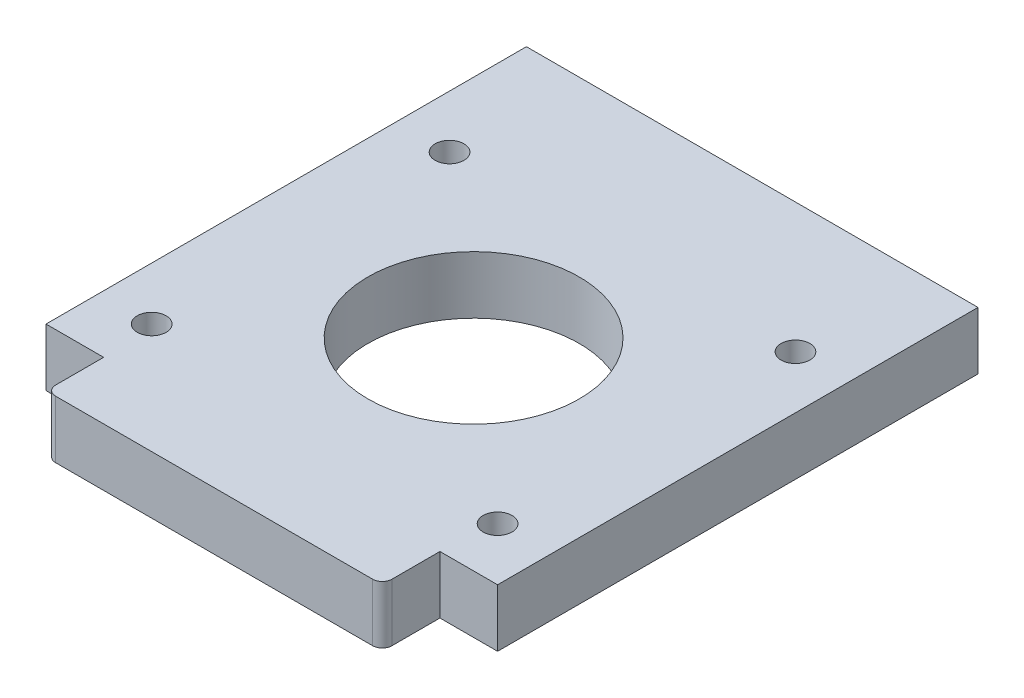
ISO-10303-21;
HEADER;
FILE_DESCRIPTION(('STEP AP214'),'2;1');
FILE_NAME('part.step','',(''),(''),'','','');
FILE_SCHEMA(('AUTOMOTIVE_DESIGN { 1 0 10303 214 1 1 1 1 }'));
ENDSEC;
DATA;
#1=APPLICATION_CONTEXT('core data for automotive mechanical design processes');
#2=APPLICATION_PROTOCOL_DEFINITION('international standard','automotive_design',2000,#1);
#3=PRODUCT_CONTEXT('',#1,'mechanical');
#4=PRODUCT('Part','Part','',(#3));
#5=PRODUCT_RELATED_PRODUCT_CATEGORY('part','',(#4));
#6=PRODUCT_DEFINITION_FORMATION('','',#4);
#7=PRODUCT_DEFINITION_CONTEXT('part definition',#1,'design');
#8=PRODUCT_DEFINITION('design','',#6,#7);
#9=PRODUCT_DEFINITION_SHAPE('','',#8);
#10=(LENGTH_UNIT() NAMED_UNIT(*) SI_UNIT(.MILLI.,.METRE.));
#11=(NAMED_UNIT(*) PLANE_ANGLE_UNIT() SI_UNIT($,.RADIAN.));
#12=(NAMED_UNIT(*) SI_UNIT($,.STERADIAN.) SOLID_ANGLE_UNIT());
#13=UNCERTAINTY_MEASURE_WITH_UNIT(LENGTH_MEASURE(1.E-05),#10,'distance_accuracy_value','');
#14=(GEOMETRIC_REPRESENTATION_CONTEXT(3) GLOBAL_UNCERTAINTY_ASSIGNED_CONTEXT((#13)) GLOBAL_UNIT_ASSIGNED_CONTEXT((#10,
#11,#12)) REPRESENTATION_CONTEXT('',''));
#15=CARTESIAN_POINT('',(0.,0.,0.));
#16=DIRECTION('',(0.,0.,1.));
#17=DIRECTION('',(1.,0.,0.));
#18=AXIS2_PLACEMENT_3D('',#15,#16,#17);
#19=CARTESIAN_POINT('',(0.,6.,0.));
#20=DIRECTION('',(0.,-1.,0.));
#21=DIRECTION('',(0.,0.,-1.));
#22=AXIS2_PLACEMENT_3D('',#19,#20,#21);
#23=PLANE('',#22);
#24=DIRECTION('',(1.,0.,0.));
#25=VECTOR('',#24,1.);
#26=CARTESIAN_POINT('',(-17.5,6.,27.));
#27=LINE('',#26,#25);
#28=CARTESIAN_POINT('',(-16.5,6.,27.));
#29=VERTEX_POINT('',#28);
#30=CARTESIAN_POINT('',(16.5,6.,27.));
#31=VERTEX_POINT('',#30);
#32=EDGE_CURVE('E177',#29,#31,#27,.T.);
#33=ORIENTED_EDGE('',*,*,#32,.T.);
#34=CARTESIAN_POINT('',(16.5,6.,26.));
#35=DIRECTION('',(0.,-1.,0.));
#36=DIRECTION('',(0.,0.,-1.));
#37=AXIS2_PLACEMENT_3D('',#34,#35,#36);
#38=CIRCLE('',#37,1.);
#39=CARTESIAN_POINT('',(17.5,6.,26.));
#40=VERTEX_POINT('',#39);
#41=EDGE_CURVE('E52',#31,#40,#38,.F.);
#42=ORIENTED_EDGE('',*,*,#41,.T.);
#43=DIRECTION('',(0.,0.,-1.));
#44=VECTOR('',#43,1.);
#45=CARTESIAN_POINT('',(17.5,6.,27.));
#46=LINE('',#45,#44);
#47=CARTESIAN_POINT('',(17.5,6.,21.));
#48=VERTEX_POINT('',#47);
#49=EDGE_CURVE('E140',#40,#48,#46,.T.);
#50=ORIENTED_EDGE('',*,*,#49,.T.);
#51=DIRECTION('',(1.,0.,0.));
#52=VECTOR('',#51,1.);
#53=CARTESIAN_POINT('',(17.5,6.,21.));
#54=LINE('',#53,#52);
#55=CARTESIAN_POINT('',(23.5,6.,21.));
#56=VERTEX_POINT('',#55);
#57=EDGE_CURVE('E135',#48,#56,#54,.T.);
#58=ORIENTED_EDGE('',*,*,#57,.T.);
#59=DIRECTION('',(0.,0.,-1.));
#60=VECTOR('',#59,1.);
#61=CARTESIAN_POINT('',(23.5,6.,-21.));
#62=LINE('',#61,#60);
#63=CARTESIAN_POINT('',(23.5,6.,-29.));
#64=VERTEX_POINT('',#63);
#65=EDGE_CURVE('E123',#56,#64,#62,.T.);
#66=ORIENTED_EDGE('',*,*,#65,.T.);
#67=DIRECTION('',(-1.,0.,0.));
#68=VECTOR('',#67,1.);
#69=CARTESIAN_POINT('',(-23.5,6.,-29.));
#70=LINE('',#69,#68);
#71=CARTESIAN_POINT('',(-23.5,6.,-29.));
#72=VERTEX_POINT('',#71);
#73=EDGE_CURVE('E134',#64,#72,#70,.T.);
#74=ORIENTED_EDGE('',*,*,#73,.T.);
#75=DIRECTION('',(0.,0.,1.));
#76=VECTOR('',#75,1.);
#77=CARTESIAN_POINT('',(-23.5,6.,-21.));
#78=LINE('',#77,#76);
#79=CARTESIAN_POINT('',(-23.5,6.,21.));
#80=VERTEX_POINT('',#79);
#81=EDGE_CURVE('E221',#72,#80,#78,.T.);
#82=ORIENTED_EDGE('',*,*,#81,.T.);
#83=DIRECTION('',(1.,0.,0.));
#84=VECTOR('',#83,1.);
#85=CARTESIAN_POINT('',(-23.5,6.,21.));
#86=LINE('',#85,#84);
#87=CARTESIAN_POINT('',(-17.5,6.,21.));
#88=VERTEX_POINT('',#87);
#89=EDGE_CURVE('E249',#80,#88,#86,.T.);
#90=ORIENTED_EDGE('',*,*,#89,.T.);
#91=DIRECTION('',(0.,0.,1.));
#92=VECTOR('',#91,1.);
#93=CARTESIAN_POINT('',(-17.5,6.,21.));
#94=LINE('',#93,#92);
#95=CARTESIAN_POINT('',(-17.5,6.,26.));
#96=VERTEX_POINT('',#95);
#97=EDGE_CURVE('E243',#88,#96,#94,.T.);
#98=ORIENTED_EDGE('',*,*,#97,.T.);
#99=CARTESIAN_POINT('',(-16.5,6.,26.));
#100=DIRECTION('',(0.,-1.,0.));
#101=DIRECTION('',(0.,0.,-1.));
#102=AXIS2_PLACEMENT_3D('',#99,#100,#101);
#103=CIRCLE('',#102,1.);
#104=EDGE_CURVE('E173',#96,#29,#103,.F.);
#105=ORIENTED_EDGE('',*,*,#104,.T.);
#106=EDGE_LOOP('',(#33,#42,#50,#58,#66,#74,#82,#90,#98,#105));
#107=FACE_BOUND('',#106,.T.);
#108=CARTESIAN_POINT('',(0.,6.,0.));
#109=DIRECTION('',(0.,1.,0.));
#110=DIRECTION('',(0.,0.,1.));
#111=AXIS2_PLACEMENT_3D('',#108,#109,#110);
#112=CIRCLE('',#111,11.);
#113=CARTESIAN_POINT('',(0.,6.,11.));
#114=VERTEX_POINT('',#113);
#115=EDGE_CURVE('E253',#114,#114,#112,.T.);
#116=ORIENTED_EDGE('',*,*,#115,.F.);
#117=EDGE_LOOP('',(#116));
#118=FACE_BOUND('',#117,.T.);
#119=CARTESIAN_POINT('',(-18.,6.,15.5));
#120=DIRECTION('',(0.,1.,0.));
#121=DIRECTION('',(0.,0.,1.));
#122=AXIS2_PLACEMENT_3D('',#119,#120,#121);
#123=CIRCLE('',#122,1.5);
#124=CARTESIAN_POINT('',(-18.,6.,17.));
#125=VERTEX_POINT('',#124);
#126=EDGE_CURVE('E262',#125,#125,#123,.T.);
#127=ORIENTED_EDGE('',*,*,#126,.F.);
#128=EDGE_LOOP('',(#127));
#129=FACE_BOUND('',#128,.T.);
#130=CARTESIAN_POINT('',(18.,6.,15.5));
#131=DIRECTION('',(0.,1.,0.));
#132=DIRECTION('',(0.,0.,-1.));
#133=AXIS2_PLACEMENT_3D('',#130,#131,#132);
#134=CIRCLE('',#133,1.5);
#135=CARTESIAN_POINT('',(18.,6.,14.));
#136=VERTEX_POINT('',#135);
#137=EDGE_CURVE('E274',#136,#136,#134,.T.);
#138=ORIENTED_EDGE('',*,*,#137,.F.);
#139=EDGE_LOOP('',(#138));
#140=FACE_BOUND('',#139,.T.);
#141=CARTESIAN_POINT('',(18.,6.,-15.5));
#142=DIRECTION('',(0.,1.,0.));
#143=DIRECTION('',(0.,0.,1.));
#144=AXIS2_PLACEMENT_3D('',#141,#142,#143);
#145=CIRCLE('',#144,1.5);
#146=CARTESIAN_POINT('',(18.,6.,-14.));
#147=VERTEX_POINT('',#146);
#148=EDGE_CURVE('E282',#147,#147,#145,.T.);
#149=ORIENTED_EDGE('',*,*,#148,.F.);
#150=EDGE_LOOP('',(#149));
#151=FACE_BOUND('',#150,.T.);
#152=CARTESIAN_POINT('',(-18.,6.,-15.5));
#153=DIRECTION('',(0.,1.,0.));
#154=DIRECTION('',(0.,0.,-1.));
#155=AXIS2_PLACEMENT_3D('',#152,#153,#154);
#156=CIRCLE('',#155,1.5);
#157=CARTESIAN_POINT('',(-18.,6.,-17.));
#158=VERTEX_POINT('',#157);
#159=EDGE_CURVE('E290',#158,#158,#156,.T.);
#160=ORIENTED_EDGE('',*,*,#159,.F.);
#161=EDGE_LOOP('',(#160));
#162=FACE_BOUND('',#161,.T.);
#163=ADVANCED_FACE('F43',(#107,#118,#129,#140,#151,#162),#23,.F.);
#164=CARTESIAN_POINT('',(0.,0.,0.));
#165=DIRECTION('',(0.,-1.,0.));
#166=DIRECTION('',(0.,0.,-1.));
#167=AXIS2_PLACEMENT_3D('',#164,#165,#166);
#168=PLANE('',#167);
#169=CARTESIAN_POINT('',(18.,0.,-15.5));
#170=DIRECTION('',(0.,1.,0.));
#171=DIRECTION('',(0.,0.,1.));
#172=AXIS2_PLACEMENT_3D('',#169,#170,#171);
#173=CIRCLE('',#172,1.5);
#174=CARTESIAN_POINT('',(18.,0.,-14.));
#175=VERTEX_POINT('',#174);
#176=EDGE_CURVE('E286',#175,#175,#173,.T.);
#177=ORIENTED_EDGE('',*,*,#176,.T.);
#178=EDGE_LOOP('',(#177));
#179=FACE_BOUND('',#178,.T.);
#180=CARTESIAN_POINT('',(-18.,0.,15.5));
#181=DIRECTION('',(0.,1.,0.));
#182=DIRECTION('',(0.,0.,1.));
#183=AXIS2_PLACEMENT_3D('',#180,#181,#182);
#184=CIRCLE('',#183,1.5);
#185=CARTESIAN_POINT('',(-18.,0.,17.));
#186=VERTEX_POINT('',#185);
#187=EDGE_CURVE('E265',#186,#186,#184,.T.);
#188=ORIENTED_EDGE('',*,*,#187,.T.);
#189=EDGE_LOOP('',(#188));
#190=FACE_BOUND('',#189,.T.);
#191=DIRECTION('',(0.,0.,-1.));
#192=VECTOR('',#191,1.);
#193=CARTESIAN_POINT('',(17.5,0.,27.));
#194=LINE('',#193,#192);
#195=CARTESIAN_POINT('',(17.5,0.,26.));
#196=VERTEX_POINT('',#195);
#197=CARTESIAN_POINT('',(17.5,0.,21.));
#198=VERTEX_POINT('',#197);
#199=EDGE_CURVE('E145',#196,#198,#194,.T.);
#200=ORIENTED_EDGE('',*,*,#199,.F.);
#201=CARTESIAN_POINT('',(16.5,0.,26.));
#202=DIRECTION('',(0.,-1.,0.));
#203=DIRECTION('',(0.,0.,-1.));
#204=AXIS2_PLACEMENT_3D('',#201,#202,#203);
#205=CIRCLE('',#204,1.);
#206=CARTESIAN_POINT('',(16.5,0.,27.));
#207=VERTEX_POINT('',#206);
#208=EDGE_CURVE('E164',#196,#207,#205,.T.);
#209=ORIENTED_EDGE('',*,*,#208,.T.);
#210=DIRECTION('',(1.,0.,0.));
#211=VECTOR('',#210,1.);
#212=CARTESIAN_POINT('',(-17.5,0.,27.));
#213=LINE('',#212,#211);
#214=CARTESIAN_POINT('',(-16.5,0.,27.));
#215=VERTEX_POINT('',#214);
#216=EDGE_CURVE('E191',#215,#207,#213,.T.);
#217=ORIENTED_EDGE('',*,*,#216,.F.);
#218=CARTESIAN_POINT('',(-16.5,0.,26.));
#219=DIRECTION('',(0.,-1.,0.));
#220=DIRECTION('',(0.,0.,-1.));
#221=AXIS2_PLACEMENT_3D('',#218,#219,#220);
#222=CIRCLE('',#221,1.);
#223=CARTESIAN_POINT('',(-17.5,0.,26.));
#224=VERTEX_POINT('',#223);
#225=EDGE_CURVE('E156',#215,#224,#222,.T.);
#226=ORIENTED_EDGE('',*,*,#225,.T.);
#227=DIRECTION('',(0.,0.,1.));
#228=VECTOR('',#227,1.);
#229=CARTESIAN_POINT('',(-17.5,0.,21.));
#230=LINE('',#229,#228);
#231=CARTESIAN_POINT('',(-17.5,0.,21.));
#232=VERTEX_POINT('',#231);
#233=EDGE_CURVE('E195',#232,#224,#230,.T.);
#234=ORIENTED_EDGE('',*,*,#233,.F.);
#235=DIRECTION('',(1.,0.,0.));
#236=VECTOR('',#235,1.);
#237=CARTESIAN_POINT('',(-23.5,0.,21.));
#238=LINE('',#237,#236);
#239=CARTESIAN_POINT('',(-23.5,0.,21.));
#240=VERTEX_POINT('',#239);
#241=EDGE_CURVE('E200',#240,#232,#238,.T.);
#242=ORIENTED_EDGE('',*,*,#241,.F.);
#243=DIRECTION('',(0.,0.,1.));
#244=VECTOR('',#243,1.);
#245=CARTESIAN_POINT('',(-23.5,0.,-21.));
#246=LINE('',#245,#244);
#247=CARTESIAN_POINT('',(-23.5,0.,-29.));
#248=VERTEX_POINT('',#247);
#249=EDGE_CURVE('E220',#248,#240,#246,.T.);
#250=ORIENTED_EDGE('',*,*,#249,.F.);
#251=DIRECTION('',(-1.,0.,0.));
#252=VECTOR('',#251,1.);
#253=CARTESIAN_POINT('',(-23.5,0.,-29.));
#254=LINE('',#253,#252);
#255=CARTESIAN_POINT('',(23.5,0.,-29.));
#256=VERTEX_POINT('',#255);
#257=EDGE_CURVE('E226',#256,#248,#254,.T.);
#258=ORIENTED_EDGE('',*,*,#257,.F.);
#259=DIRECTION('',(0.,0.,-1.));
#260=VECTOR('',#259,1.);
#261=CARTESIAN_POINT('',(23.5,0.,-29.));
#262=LINE('',#261,#260);
#263=CARTESIAN_POINT('',(23.5,0.,21.));
#264=VERTEX_POINT('',#263);
#265=EDGE_CURVE('E228',#264,#256,#262,.T.);
#266=ORIENTED_EDGE('',*,*,#265,.F.);
#267=DIRECTION('',(1.,0.,0.));
#268=VECTOR('',#267,1.);
#269=CARTESIAN_POINT('',(17.5,0.,21.));
#270=LINE('',#269,#268);
#271=EDGE_CURVE('E149',#198,#264,#270,.T.);
#272=ORIENTED_EDGE('',*,*,#271,.F.);
#273=EDGE_LOOP('',(#200,#209,#217,#226,#234,#242,#250,#258,#266,#272));
#274=FACE_BOUND('',#273,.T.);
#275=CARTESIAN_POINT('',(0.,0.,0.));
#276=DIRECTION('',(0.,1.,0.));
#277=DIRECTION('',(0.,0.,1.));
#278=AXIS2_PLACEMENT_3D('',#275,#276,#277);
#279=CIRCLE('',#278,11.);
#280=CARTESIAN_POINT('',(0.,0.,11.));
#281=VERTEX_POINT('',#280);
#282=EDGE_CURVE('E256',#281,#281,#279,.T.);
#283=ORIENTED_EDGE('',*,*,#282,.T.);
#284=EDGE_LOOP('',(#283));
#285=FACE_BOUND('',#284,.T.);
#286=CARTESIAN_POINT('',(18.,0.,15.5));
#287=DIRECTION('',(0.,1.,0.));
#288=DIRECTION('',(0.,0.,-1.));
#289=AXIS2_PLACEMENT_3D('',#286,#287,#288);
#290=CIRCLE('',#289,1.5);
#291=CARTESIAN_POINT('',(18.,0.,14.));
#292=VERTEX_POINT('',#291);
#293=EDGE_CURVE('E278',#292,#292,#290,.T.);
#294=ORIENTED_EDGE('',*,*,#293,.T.);
#295=EDGE_LOOP('',(#294));
#296=FACE_BOUND('',#295,.T.);
#297=CARTESIAN_POINT('',(-18.,0.,-15.5));
#298=DIRECTION('',(0.,1.,0.));
#299=DIRECTION('',(0.,0.,-1.));
#300=AXIS2_PLACEMENT_3D('',#297,#298,#299);
#301=CIRCLE('',#300,1.5);
#302=CARTESIAN_POINT('',(-18.,0.,-17.));
#303=VERTEX_POINT('',#302);
#304=EDGE_CURVE('E294',#303,#303,#301,.T.);
#305=ORIENTED_EDGE('',*,*,#304,.T.);
#306=EDGE_LOOP('',(#305));
#307=FACE_BOUND('',#306,.T.);
#308=ADVANCED_FACE('F189',(#179,#190,#274,#285,#296,#307),#168,.T.);
#309=CARTESIAN_POINT('',(17.5,6.,21.));
#310=DIRECTION('',(0.,0.,-1.));
#311=DIRECTION('',(-1.,0.,0.));
#312=AXIS2_PLACEMENT_3D('',#309,#310,#311);
#313=PLANE('',#312);
#314=ORIENTED_EDGE('',*,*,#271,.T.);
#315=DIRECTION('',(0.,-1.,0.));
#316=VECTOR('',#315,1.);
#317=CARTESIAN_POINT('',(23.5,6.,21.));
#318=LINE('',#317,#316);
#319=EDGE_CURVE('E127',#56,#264,#318,.T.);
#320=ORIENTED_EDGE('',*,*,#319,.F.);
#321=ORIENTED_EDGE('',*,*,#57,.F.);
#322=DIRECTION('',(0.,-1.,0.));
#323=VECTOR('',#322,1.);
#324=CARTESIAN_POINT('',(17.5,6.,21.));
#325=LINE('',#324,#323);
#326=EDGE_CURVE('E183',#48,#198,#325,.T.);
#327=ORIENTED_EDGE('',*,*,#326,.T.);
#328=EDGE_LOOP('',(#314,#320,#321,#327));
#329=FACE_BOUND('',#328,.T.);
#330=ADVANCED_FACE('F147',(#329),#313,.F.);
#331=CARTESIAN_POINT('',(23.5,6.,-29.));
#332=DIRECTION('',(-1.,0.,0.));
#333=DIRECTION('',(0.,0.,1.));
#334=AXIS2_PLACEMENT_3D('',#331,#332,#333);
#335=PLANE('',#334);
#336=ORIENTED_EDGE('',*,*,#265,.T.);
#337=DIRECTION('',(0.,-1.,0.));
#338=VECTOR('',#337,1.);
#339=CARTESIAN_POINT('',(23.5,6.,-29.));
#340=LINE('',#339,#338);
#341=EDGE_CURVE('E130',#64,#256,#340,.T.);
#342=ORIENTED_EDGE('',*,*,#341,.F.);
#343=ORIENTED_EDGE('',*,*,#65,.F.);
#344=ORIENTED_EDGE('',*,*,#319,.T.);
#345=EDGE_LOOP('',(#336,#342,#343,#344));
#346=FACE_BOUND('',#345,.T.);
#347=ADVANCED_FACE('F125',(#346),#335,.F.);
#348=CARTESIAN_POINT('',(-23.5,6.,-29.));
#349=DIRECTION('',(0.,0.,1.));
#350=DIRECTION('',(1.,0.,0.));
#351=AXIS2_PLACEMENT_3D('',#348,#349,#350);
#352=PLANE('',#351);
#353=ORIENTED_EDGE('',*,*,#257,.T.);
#354=DIRECTION('',(0.,-1.,0.));
#355=VECTOR('',#354,1.);
#356=CARTESIAN_POINT('',(-23.5,6.,-29.));
#357=LINE('',#356,#355);
#358=EDGE_CURVE('E158',#72,#248,#357,.T.);
#359=ORIENTED_EDGE('',*,*,#358,.F.);
#360=ORIENTED_EDGE('',*,*,#73,.F.);
#361=ORIENTED_EDGE('',*,*,#341,.T.);
#362=EDGE_LOOP('',(#353,#359,#360,#361));
#363=FACE_BOUND('',#362,.T.);
#364=ADVANCED_FACE('F224',(#363),#352,.F.);
#365=CARTESIAN_POINT('',(-23.5,6.,-21.));
#366=DIRECTION('',(1.,0.,0.));
#367=DIRECTION('',(0.,0.,-1.));
#368=AXIS2_PLACEMENT_3D('',#365,#366,#367);
#369=PLANE('',#368);
#370=ORIENTED_EDGE('',*,*,#249,.T.);
#371=DIRECTION('',(0.,-1.,0.));
#372=VECTOR('',#371,1.);
#373=CARTESIAN_POINT('',(-23.5,6.,21.));
#374=LINE('',#373,#372);
#375=EDGE_CURVE('E210',#80,#240,#374,.T.);
#376=ORIENTED_EDGE('',*,*,#375,.F.);
#377=ORIENTED_EDGE('',*,*,#81,.F.);
#378=ORIENTED_EDGE('',*,*,#358,.T.);
#379=EDGE_LOOP('',(#370,#376,#377,#378));
#380=FACE_BOUND('',#379,.T.);
#381=ADVANCED_FACE('F218',(#380),#369,.F.);
#382=CARTESIAN_POINT('',(-23.5,6.,21.));
#383=DIRECTION('',(0.,0.,-1.));
#384=DIRECTION('',(-1.,0.,0.));
#385=AXIS2_PLACEMENT_3D('',#382,#383,#384);
#386=PLANE('',#385);
#387=ORIENTED_EDGE('',*,*,#241,.T.);
#388=DIRECTION('',(0.,-1.,0.));
#389=VECTOR('',#388,1.);
#390=CARTESIAN_POINT('',(-17.5,6.,21.));
#391=LINE('',#390,#389);
#392=EDGE_CURVE('E206',#88,#232,#391,.T.);
#393=ORIENTED_EDGE('',*,*,#392,.F.);
#394=ORIENTED_EDGE('',*,*,#89,.F.);
#395=ORIENTED_EDGE('',*,*,#375,.T.);
#396=EDGE_LOOP('',(#387,#393,#394,#395));
#397=FACE_BOUND('',#396,.T.);
#398=ADVANCED_FACE('F239',(#397),#386,.F.);
#399=CARTESIAN_POINT('',(-17.5,6.,21.));
#400=DIRECTION('',(1.,0.,0.));
#401=DIRECTION('',(0.,0.,-1.));
#402=AXIS2_PLACEMENT_3D('',#399,#400,#401);
#403=PLANE('',#402);
#404=ORIENTED_EDGE('',*,*,#233,.T.);
#405=DIRECTION('',(0.,-1.,0.));
#406=VECTOR('',#405,1.);
#407=CARTESIAN_POINT('',(-17.5,6.,26.));
#408=LINE('',#407,#406);
#409=EDGE_CURVE('E11',#224,#96,#408,.F.);
#410=ORIENTED_EDGE('',*,*,#409,.T.);
#411=ORIENTED_EDGE('',*,*,#97,.F.);
#412=ORIENTED_EDGE('',*,*,#392,.T.);
#413=EDGE_LOOP('',(#404,#410,#411,#412));
#414=FACE_BOUND('',#413,.T.);
#415=ADVANCED_FACE('F242',(#414),#403,.F.);
#416=CARTESIAN_POINT('',(-17.5,6.,27.));
#417=DIRECTION('',(0.,0.,-1.));
#418=DIRECTION('',(-1.,0.,0.));
#419=AXIS2_PLACEMENT_3D('',#416,#417,#418);
#420=PLANE('',#419);
#421=ORIENTED_EDGE('',*,*,#216,.T.);
#422=DIRECTION('',(0.,-1.,0.));
#423=VECTOR('',#422,1.);
#424=CARTESIAN_POINT('',(16.5,6.,27.));
#425=LINE('',#424,#423);
#426=EDGE_CURVE('E65',#207,#31,#425,.F.);
#427=ORIENTED_EDGE('',*,*,#426,.T.);
#428=ORIENTED_EDGE('',*,*,#32,.F.);
#429=DIRECTION('',(0.,-1.,0.));
#430=VECTOR('',#429,1.);
#431=CARTESIAN_POINT('',(-16.5,6.,27.));
#432=LINE('',#431,#430);
#433=EDGE_CURVE('E167',#29,#215,#432,.T.);
#434=ORIENTED_EDGE('',*,*,#433,.T.);
#435=EDGE_LOOP('',(#421,#427,#428,#434));
#436=FACE_BOUND('',#435,.T.);
#437=ADVANCED_FACE('F192',(#436),#420,.F.);
#438=CARTESIAN_POINT('',(17.5,6.,27.));
#439=DIRECTION('',(-1.,0.,0.));
#440=DIRECTION('',(0.,0.,1.));
#441=AXIS2_PLACEMENT_3D('',#438,#439,#440);
#442=PLANE('',#441);
#443=ORIENTED_EDGE('',*,*,#49,.F.);
#444=DIRECTION('',(0.,-1.,0.));
#445=VECTOR('',#444,1.);
#446=CARTESIAN_POINT('',(17.5,6.,26.));
#447=LINE('',#446,#445);
#448=EDGE_CURVE('E151',#40,#196,#447,.T.);
#449=ORIENTED_EDGE('',*,*,#448,.T.);
#450=ORIENTED_EDGE('',*,*,#199,.T.);
#451=ORIENTED_EDGE('',*,*,#326,.F.);
#452=EDGE_LOOP('',(#443,#449,#450,#451));
#453=FACE_BOUND('',#452,.T.);
#454=ADVANCED_FACE('F181',(#453),#442,.F.);
#455=CARTESIAN_POINT('',(0.,6.,0.));
#456=DIRECTION('',(0.,-1.,0.));
#457=DIRECTION('',(0.,0.,-1.));
#458=AXIS2_PLACEMENT_3D('',#455,#456,#457);
#459=CYLINDRICAL_SURFACE('',#458,11.);
#460=ORIENTED_EDGE('',*,*,#115,.T.);
#461=EDGE_LOOP('',(#460));
#462=FACE_BOUND('',#461,.T.);
#463=ORIENTED_EDGE('',*,*,#282,.F.);
#464=EDGE_LOOP('',(#463));
#465=FACE_BOUND('',#464,.T.);
#466=ADVANCED_FACE('F313',(#462,#465),#459,.F.);
#467=CARTESIAN_POINT('',(-18.,6.,15.5));
#468=DIRECTION('',(0.,-1.,0.));
#469=DIRECTION('',(0.,0.,-1.));
#470=AXIS2_PLACEMENT_3D('',#467,#468,#469);
#471=CYLINDRICAL_SURFACE('',#470,1.5);
#472=ORIENTED_EDGE('',*,*,#126,.T.);
#473=EDGE_LOOP('',(#472));
#474=FACE_BOUND('',#473,.T.);
#475=ORIENTED_EDGE('',*,*,#187,.F.);
#476=EDGE_LOOP('',(#475));
#477=FACE_BOUND('',#476,.T.);
#478=ADVANCED_FACE('F346',(#474,#477),#471,.F.);
#479=CARTESIAN_POINT('',(18.,6.,15.5));
#480=DIRECTION('',(0.,-1.,0.));
#481=DIRECTION('',(0.,0.,-1.));
#482=AXIS2_PLACEMENT_3D('',#479,#480,#481);
#483=CYLINDRICAL_SURFACE('',#482,1.5);
#484=ORIENTED_EDGE('',*,*,#137,.T.);
#485=EDGE_LOOP('',(#484));
#486=FACE_BOUND('',#485,.T.);
#487=ORIENTED_EDGE('',*,*,#293,.F.);
#488=EDGE_LOOP('',(#487));
#489=FACE_BOUND('',#488,.T.);
#490=ADVANCED_FACE('F341',(#486,#489),#483,.F.);
#491=CARTESIAN_POINT('',(18.,6.,-15.5));
#492=DIRECTION('',(0.,-1.,0.));
#493=DIRECTION('',(0.,0.,-1.));
#494=AXIS2_PLACEMENT_3D('',#491,#492,#493);
#495=CYLINDRICAL_SURFACE('',#494,1.5);
#496=ORIENTED_EDGE('',*,*,#148,.T.);
#497=EDGE_LOOP('',(#496));
#498=FACE_BOUND('',#497,.T.);
#499=ORIENTED_EDGE('',*,*,#176,.F.);
#500=EDGE_LOOP('',(#499));
#501=FACE_BOUND('',#500,.T.);
#502=ADVANCED_FACE('F336',(#498,#501),#495,.F.);
#503=CARTESIAN_POINT('',(-18.,6.,-15.5));
#504=DIRECTION('',(0.,-1.,0.));
#505=DIRECTION('',(0.,0.,-1.));
#506=AXIS2_PLACEMENT_3D('',#503,#504,#505);
#507=CYLINDRICAL_SURFACE('',#506,1.5);
#508=ORIENTED_EDGE('',*,*,#159,.T.);
#509=EDGE_LOOP('',(#508));
#510=FACE_BOUND('',#509,.T.);
#511=ORIENTED_EDGE('',*,*,#304,.F.);
#512=EDGE_LOOP('',(#511));
#513=FACE_BOUND('',#512,.T.);
#514=ADVANCED_FACE('F302',(#510,#513),#507,.F.);
#515=CARTESIAN_POINT('',(16.5,6.,26.));
#516=DIRECTION('',(0.,-1.,0.));
#517=DIRECTION('',(0.,0.,-1.));
#518=AXIS2_PLACEMENT_3D('',#515,#516,#517);
#519=CYLINDRICAL_SURFACE('',#518,1.);
#520=ORIENTED_EDGE('',*,*,#41,.F.);
#521=ORIENTED_EDGE('',*,*,#426,.F.);
#522=ORIENTED_EDGE('',*,*,#208,.F.);
#523=ORIENTED_EDGE('',*,*,#448,.F.);
#524=EDGE_LOOP('',(#520,#521,#522,#523));
#525=FACE_BOUND('',#524,.T.);
#526=ADVANCED_FACE('F186',(#525),#519,.T.);
#527=CARTESIAN_POINT('',(-16.5,6.,26.));
#528=DIRECTION('',(0.,-1.,0.));
#529=DIRECTION('',(0.,0.,-1.));
#530=AXIS2_PLACEMENT_3D('',#527,#528,#529);
#531=CYLINDRICAL_SURFACE('',#530,1.);
#532=ORIENTED_EDGE('',*,*,#104,.F.);
#533=ORIENTED_EDGE('',*,*,#409,.F.);
#534=ORIENTED_EDGE('',*,*,#225,.F.);
#535=ORIENTED_EDGE('',*,*,#433,.F.);
#536=EDGE_LOOP('',(#532,#533,#534,#535));
#537=FACE_BOUND('',#536,.T.);
#538=ADVANCED_FACE('F45',(#537),#531,.T.);
#539=CLOSED_SHELL('',(#163,#308,#330,#347,#364,#381,#398,#415,#437,#454,#466,#478,#490,#502,
#514,#526,#538));
#540=MANIFOLD_SOLID_BREP('B2',#539);
#541=ADVANCED_BREP_SHAPE_REPRESENTATION('',(#18,#540),#14);
#542=SHAPE_DEFINITION_REPRESENTATION(#9,#541);
ENDSEC;
END-ISO-10303-21;
